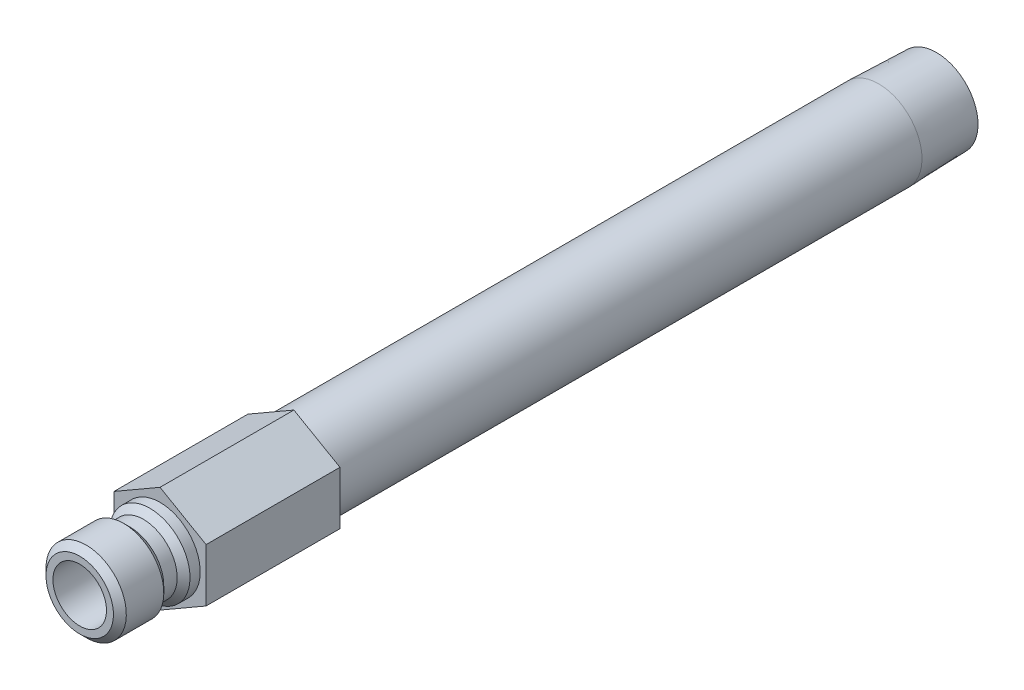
from build123d import *

# Parameters (mm, degrees)
SKETCH2_R           = 2.38125
BOSS_EXTRUDE1_DEPTH = 15.875


with BuildPart() as part:
    # Sketch1 → Revolve1 (revolve)
    with BuildSketch(Plane(origin=(0, 0, 0), x_dir=(0, 0, -1), z_dir=(1, 0, 0))):
        Polygon((-9.525, 3.175), (-9.525, 4.0005), (-8.763, 4.7625), (-4.318, 4.7625), (-3.556, 4.0005), (-1.9685, 4.0005), (-1.2065, 4.7625), (0, 4.7625), (0, 5.1435), (85.217, 5.1435), (92.075, 4.929188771), (92.075, 2.38125), (0.127, 2.38125), (0.127, 3.175), align=None)
    revolve(axis=Axis((0, 0, 0), (0, 0, 1)))

    # Sketch2 → Boss-Extrude1 (add)
    with BuildSketch(Plane.XY):
        Polygon((-5.461, 3.15290982), (-5.461, -3.15290982), (0, -6.30581964), (5.461, -3.15290982), (5.461, 3.15290982), (0, 6.30581964), align=None)
        with Locations(Location((0, 0, 0), (0, 0, 90))):
            Circle(SKETCH2_R, mode=Mode.SUBTRACT)
    extrude(amount=-BOSS_EXTRUDE1_DEPTH)


solid = part.part
